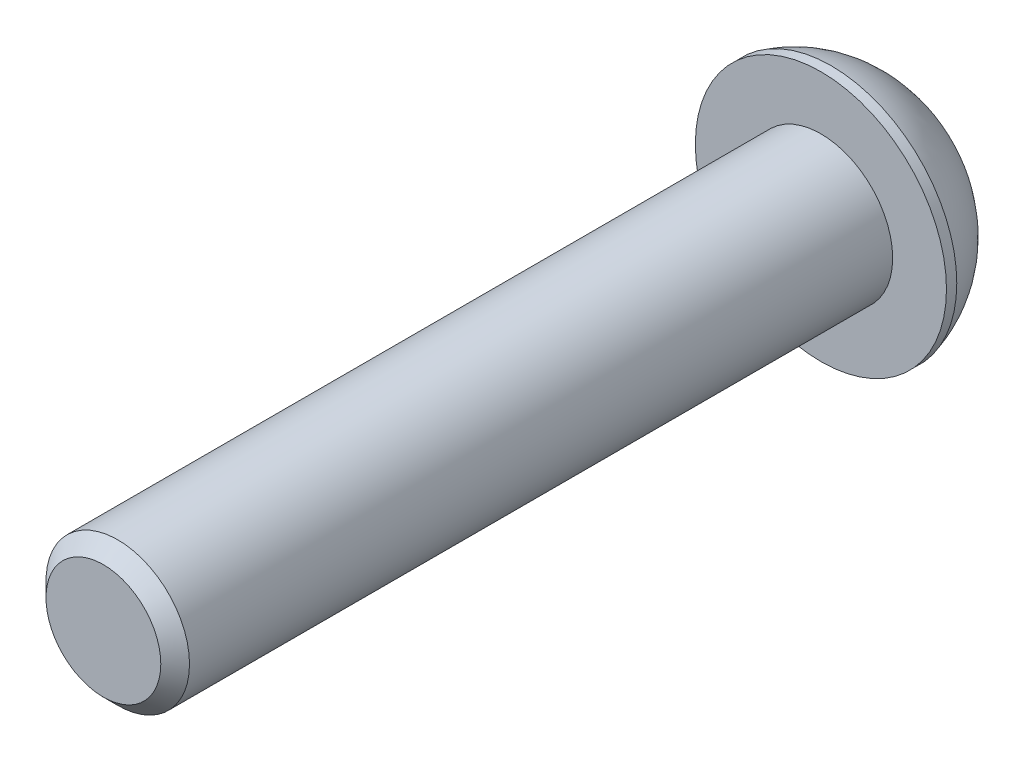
ISO-10303-21;
HEADER;
FILE_DESCRIPTION(('STEP AP214'),'2;1');
FILE_NAME('part.step','',(''),(''),'','','');
FILE_SCHEMA(('AUTOMOTIVE_DESIGN { 1 0 10303 214 1 1 1 1 }'));
ENDSEC;
DATA;
#1=APPLICATION_CONTEXT('core data for automotive mechanical design processes');
#2=APPLICATION_PROTOCOL_DEFINITION('international standard','automotive_design',2000,#1);
#3=PRODUCT_CONTEXT('',#1,'mechanical');
#4=PRODUCT('Part','Part','',(#3));
#5=PRODUCT_RELATED_PRODUCT_CATEGORY('part','',(#4));
#6=PRODUCT_DEFINITION_FORMATION('','',#4);
#7=PRODUCT_DEFINITION_CONTEXT('part definition',#1,'design');
#8=PRODUCT_DEFINITION('design','',#6,#7);
#9=PRODUCT_DEFINITION_SHAPE('','',#8);
#10=(LENGTH_UNIT() NAMED_UNIT(*) SI_UNIT(.MILLI.,.METRE.));
#11=(NAMED_UNIT(*) PLANE_ANGLE_UNIT() SI_UNIT($,.RADIAN.));
#12=(NAMED_UNIT(*) SI_UNIT($,.STERADIAN.) SOLID_ANGLE_UNIT());
#13=UNCERTAINTY_MEASURE_WITH_UNIT(LENGTH_MEASURE(1.E-05),#10,'distance_accuracy_value','');
#14=(GEOMETRIC_REPRESENTATION_CONTEXT(3) GLOBAL_UNCERTAINTY_ASSIGNED_CONTEXT((#13)) GLOBAL_UNIT_ASSIGNED_CONTEXT((#10,
#11,#12)) REPRESENTATION_CONTEXT('',''));
#15=CARTESIAN_POINT('',(0.,0.,0.));
#16=DIRECTION('',(0.,0.,1.));
#17=DIRECTION('',(1.,0.,0.));
#18=AXIS2_PLACEMENT_3D('',#15,#16,#17);
#19=CARTESIAN_POINT('',(0.,0.,-4.4));
#20=DIRECTION('',(0.,0.,1.));
#21=DIRECTION('',(1.,0.,0.));
#22=AXIS2_PLACEMENT_3D('',#19,#20,#21);
#23=PLANE('',#22);
#24=CARTESIAN_POINT('',(0.,0.,-4.4));
#25=DIRECTION('',(0.,0.,-1.));
#26=DIRECTION('',(-1.,0.,0.));
#27=AXIS2_PLACEMENT_3D('',#24,#25,#26);
#28=CIRCLE('',#27,4.06492341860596);
#29=CARTESIAN_POINT('',(-4.06492341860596,0.,-4.4));
#30=VERTEX_POINT('',#29);
#31=EDGE_CURVE('E148',#30,#30,#28,.T.);
#32=ORIENTED_EDGE('',*,*,#31,.T.);
#33=EDGE_LOOP('',(#32));
#34=FACE_BOUND('',#33,.T.);
#35=DIRECTION('',(-0.86602540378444,0.499999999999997,0.));
#36=VECTOR('',#35,1.);
#37=CARTESIAN_POINT('',(0.,2.88675134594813,-4.4));
#38=LINE('',#37,#36);
#39=CARTESIAN_POINT('',(2.5,1.44337567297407,-4.4));
#40=VERTEX_POINT('',#39);
#41=CARTESIAN_POINT('',(0.,2.88675134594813,-4.4));
#42=VERTEX_POINT('',#41);
#43=EDGE_CURVE('E50',#40,#42,#38,.T.);
#44=ORIENTED_EDGE('',*,*,#43,.T.);
#45=DIRECTION('',(-0.866025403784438,-0.500000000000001,0.));
#46=VECTOR('',#45,1.);
#47=CARTESIAN_POINT('',(0.,2.88675134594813,-4.4));
#48=LINE('',#47,#46);
#49=CARTESIAN_POINT('',(-2.5,1.44337567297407,-4.4));
#50=VERTEX_POINT('',#49);
#51=EDGE_CURVE('E121',#42,#50,#48,.T.);
#52=ORIENTED_EDGE('',*,*,#51,.T.);
#53=DIRECTION('',(0.,-1.,0.));
#54=VECTOR('',#53,1.);
#55=CARTESIAN_POINT('',(-2.5,-1.44337567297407,-4.4));
#56=LINE('',#55,#54);
#57=CARTESIAN_POINT('',(-2.5,-1.44337567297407,-4.4));
#58=VERTEX_POINT('',#57);
#59=EDGE_CURVE('E125',#50,#58,#56,.T.);
#60=ORIENTED_EDGE('',*,*,#59,.T.);
#61=DIRECTION('',(0.866025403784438,-0.500000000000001,0.));
#62=VECTOR('',#61,1.);
#63=CARTESIAN_POINT('',(0.,-2.88675134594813,-4.4));
#64=LINE('',#63,#62);
#65=CARTESIAN_POINT('',(0.,-2.88675134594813,-4.4));
#66=VERTEX_POINT('',#65);
#67=EDGE_CURVE('E128',#58,#66,#64,.T.);
#68=ORIENTED_EDGE('',*,*,#67,.T.);
#69=DIRECTION('',(0.86602540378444,0.499999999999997,0.));
#70=VECTOR('',#69,1.);
#71=CARTESIAN_POINT('',(0.,-2.88675134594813,-4.4));
#72=LINE('',#71,#70);
#73=CARTESIAN_POINT('',(2.5,-1.44337567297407,-4.4));
#74=VERTEX_POINT('',#73);
#75=EDGE_CURVE('E111',#66,#74,#72,.T.);
#76=ORIENTED_EDGE('',*,*,#75,.T.);
#77=DIRECTION('',(0.,1.,0.));
#78=VECTOR('',#77,1.);
#79=CARTESIAN_POINT('',(2.5,-1.44337567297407,-4.4));
#80=LINE('',#79,#78);
#81=EDGE_CURVE('E131',#74,#40,#80,.T.);
#82=ORIENTED_EDGE('',*,*,#81,.T.);
#83=EDGE_LOOP('',(#44,#52,#60,#68,#76,#82));
#84=FACE_BOUND('',#83,.T.);
#85=ADVANCED_FACE('F35',(#34,#84),#23,.F.);
#86=CARTESIAN_POINT('',(0.,0.,1.05548398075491));
#87=DIRECTION('',(0.,0.,-1.));
#88=DIRECTION('',(-1.,0.,0.));
#89=AXIS2_PLACEMENT_3D('',#86,#87,#88);
#90=DEGENERATE_TOROIDAL_SURFACE('',#89,0.915198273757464,6.29945028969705,.T.);
#91=ORIENTED_EDGE('',*,*,#31,.F.);
#92=EDGE_LOOP('',(#91));
#93=FACE_BOUND('',#92,.T.);
#94=CARTESIAN_POINT('',(0.,0.,-0.574933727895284));
#95=DIRECTION('',(0.,0.,-1.));
#96=DIRECTION('',(-1.,0.,0.));
#97=AXIS2_PLACEMENT_3D('',#94,#95,#96);
#98=CIRCLE('',#97,7.);
#99=CARTESIAN_POINT('',(-7.,0.,-0.574933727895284));
#100=VERTEX_POINT('',#99);
#101=EDGE_CURVE('E145',#100,#100,#98,.T.);
#102=ORIENTED_EDGE('',*,*,#101,.T.);
#103=EDGE_LOOP('',(#102));
#104=FACE_BOUND('',#103,.T.);
#105=ADVANCED_FACE('F165',(#93,#104),#90,.T.);
#106=CARTESIAN_POINT('',(0.,0.,0.));
#107=DIRECTION('',(0.,0.,-1.));
#108=DIRECTION('',(-1.,0.,0.));
#109=AXIS2_PLACEMENT_3D('',#106,#107,#108);
#110=CYLINDRICAL_SURFACE('',#109,7.);
#111=ORIENTED_EDGE('',*,*,#101,.F.);
#112=EDGE_LOOP('',(#111));
#113=FACE_BOUND('',#112,.T.);
#114=CARTESIAN_POINT('',(0.,0.,0.));
#115=DIRECTION('',(0.,0.,-1.));
#116=DIRECTION('',(-1.,0.,0.));
#117=AXIS2_PLACEMENT_3D('',#114,#115,#116);
#118=CIRCLE('',#117,7.);
#119=CARTESIAN_POINT('',(-7.,0.,0.));
#120=VERTEX_POINT('',#119);
#121=EDGE_CURVE('E142',#120,#120,#118,.T.);
#122=ORIENTED_EDGE('',*,*,#121,.T.);
#123=EDGE_LOOP('',(#122));
#124=FACE_BOUND('',#123,.T.);
#125=ADVANCED_FACE('F170',(#113,#124),#110,.T.);
#126=CARTESIAN_POINT('',(0.,0.,0.));
#127=DIRECTION('',(0.,0.,-1.));
#128=DIRECTION('',(-1.,0.,0.));
#129=AXIS2_PLACEMENT_3D('',#126,#127,#128);
#130=PLANE('',#129);
#131=CARTESIAN_POINT('',(0.,0.,0.));
#132=DIRECTION('',(0.,0.,1.));
#133=DIRECTION('',(1.,0.,0.));
#134=AXIS2_PLACEMENT_3D('',#131,#132,#133);
#135=CIRCLE('',#134,4.);
#136=CARTESIAN_POINT('',(4.,0.,0.));
#137=VERTEX_POINT('',#136);
#138=EDGE_CURVE('E122',#137,#137,#135,.T.);
#139=ORIENTED_EDGE('',*,*,#138,.F.);
#140=EDGE_LOOP('',(#139));
#141=FACE_BOUND('',#140,.T.);
#142=ORIENTED_EDGE('',*,*,#121,.F.);
#143=EDGE_LOOP('',(#142));
#144=FACE_BOUND('',#143,.T.);
#145=ADVANCED_FACE('F177',(#141,#144),#130,.F.);
#146=CARTESIAN_POINT('',(0.,2.88675134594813,-1.8));
#147=DIRECTION('',(-0.499999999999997,-0.86602540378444,0.));
#148=DIRECTION('',(0.86602540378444,-0.499999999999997,0.));
#149=AXIS2_PLACEMENT_3D('',#146,#147,#148);
#150=PLANE('',#149);
#151=ORIENTED_EDGE('',*,*,#43,.F.);
#152=DIRECTION('',(0.,0.,-1.));
#153=VECTOR('',#152,1.);
#154=CARTESIAN_POINT('',(2.5,1.44337567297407,-1.8));
#155=LINE('',#154,#153);
#156=CARTESIAN_POINT('',(2.5,1.44337567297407,-1.8));
#157=VERTEX_POINT('',#156);
#158=EDGE_CURVE('E116',#157,#40,#155,.T.);
#159=ORIENTED_EDGE('',*,*,#158,.F.);
#160=DIRECTION('',(-0.86602540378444,0.499999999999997,0.));
#161=VECTOR('',#160,1.);
#162=CARTESIAN_POINT('',(0.,2.88675134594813,-1.8));
#163=LINE('',#162,#161);
#164=CARTESIAN_POINT('',(0.,2.88675134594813,-1.8));
#165=VERTEX_POINT('',#164);
#166=EDGE_CURVE('E134',#157,#165,#163,.T.);
#167=ORIENTED_EDGE('',*,*,#166,.T.);
#168=DIRECTION('',(0.,0.,-1.));
#169=VECTOR('',#168,1.);
#170=CARTESIAN_POINT('',(0.,2.88675134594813,-1.8));
#171=LINE('',#170,#169);
#172=EDGE_CURVE('E140',#165,#42,#171,.T.);
#173=ORIENTED_EDGE('',*,*,#172,.T.);
#174=EDGE_LOOP('',(#151,#159,#167,#173));
#175=FACE_BOUND('',#174,.T.);
#176=ADVANCED_FACE('F181',(#175),#150,.T.);
#177=CARTESIAN_POINT('',(0.,2.88675134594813,-1.8));
#178=DIRECTION('',(0.500000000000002,-0.866025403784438,0.));
#179=DIRECTION('',(0.866025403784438,0.500000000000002,0.));
#180=AXIS2_PLACEMENT_3D('',#177,#178,#179);
#181=PLANE('',#180);
#182=ORIENTED_EDGE('',*,*,#51,.F.);
#183=ORIENTED_EDGE('',*,*,#172,.F.);
#184=DIRECTION('',(-0.866025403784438,-0.500000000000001,0.));
#185=VECTOR('',#184,1.);
#186=CARTESIAN_POINT('',(0.,2.88675134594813,-1.8));
#187=LINE('',#186,#185);
#188=CARTESIAN_POINT('',(-2.5,1.44337567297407,-1.8));
#189=VERTEX_POINT('',#188);
#190=EDGE_CURVE('E89',#165,#189,#187,.T.);
#191=ORIENTED_EDGE('',*,*,#190,.T.);
#192=DIRECTION('',(0.,0.,-1.));
#193=VECTOR('',#192,1.);
#194=CARTESIAN_POINT('',(-2.5,1.44337567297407,-1.8));
#195=LINE('',#194,#193);
#196=EDGE_CURVE('E138',#189,#50,#195,.T.);
#197=ORIENTED_EDGE('',*,*,#196,.T.);
#198=EDGE_LOOP('',(#182,#183,#191,#197));
#199=FACE_BOUND('',#198,.T.);
#200=ADVANCED_FACE('F185',(#199),#181,.T.);
#201=CARTESIAN_POINT('',(-2.5,-1.44337567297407,-1.8));
#202=DIRECTION('',(1.,0.,0.));
#203=DIRECTION('',(0.,0.,-1.));
#204=AXIS2_PLACEMENT_3D('',#201,#202,#203);
#205=PLANE('',#204);
#206=ORIENTED_EDGE('',*,*,#59,.F.);
#207=ORIENTED_EDGE('',*,*,#196,.F.);
#208=DIRECTION('',(0.,-1.,0.));
#209=VECTOR('',#208,1.);
#210=CARTESIAN_POINT('',(-2.5,-1.44337567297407,-1.8));
#211=LINE('',#210,#209);
#212=CARTESIAN_POINT('',(-2.5,-1.44337567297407,-1.8));
#213=VERTEX_POINT('',#212);
#214=EDGE_CURVE('E107',#189,#213,#211,.T.);
#215=ORIENTED_EDGE('',*,*,#214,.T.);
#216=DIRECTION('',(0.,0.,-1.));
#217=VECTOR('',#216,1.);
#218=CARTESIAN_POINT('',(-2.5,-1.44337567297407,-1.8));
#219=LINE('',#218,#217);
#220=EDGE_CURVE('E104',#213,#58,#219,.T.);
#221=ORIENTED_EDGE('',*,*,#220,.T.);
#222=EDGE_LOOP('',(#206,#207,#215,#221));
#223=FACE_BOUND('',#222,.T.);
#224=ADVANCED_FACE('F188',(#223),#205,.T.);
#225=CARTESIAN_POINT('',(0.,-2.88675134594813,-1.8));
#226=DIRECTION('',(0.500000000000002,0.866025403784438,0.));
#227=DIRECTION('',(-0.866025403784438,0.500000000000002,0.));
#228=AXIS2_PLACEMENT_3D('',#225,#226,#227);
#229=PLANE('',#228);
#230=ORIENTED_EDGE('',*,*,#67,.F.);
#231=ORIENTED_EDGE('',*,*,#220,.F.);
#232=DIRECTION('',(0.866025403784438,-0.500000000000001,0.));
#233=VECTOR('',#232,1.);
#234=CARTESIAN_POINT('',(0.,-2.88675134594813,-1.8));
#235=LINE('',#234,#233);
#236=CARTESIAN_POINT('',(0.,-2.88675134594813,-1.8));
#237=VERTEX_POINT('',#236);
#238=EDGE_CURVE('E99',#213,#237,#235,.T.);
#239=ORIENTED_EDGE('',*,*,#238,.T.);
#240=DIRECTION('',(0.,0.,-1.));
#241=VECTOR('',#240,1.);
#242=CARTESIAN_POINT('',(0.,-2.88675134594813,-1.8));
#243=LINE('',#242,#241);
#244=EDGE_CURVE('E103',#237,#66,#243,.T.);
#245=ORIENTED_EDGE('',*,*,#244,.T.);
#246=EDGE_LOOP('',(#230,#231,#239,#245));
#247=FACE_BOUND('',#246,.T.);
#248=ADVANCED_FACE('F102',(#247),#229,.T.);
#249=CARTESIAN_POINT('',(0.,-2.88675134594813,-1.8));
#250=DIRECTION('',(-0.499999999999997,0.86602540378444,0.));
#251=DIRECTION('',(-0.86602540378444,-0.499999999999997,0.));
#252=AXIS2_PLACEMENT_3D('',#249,#250,#251);
#253=PLANE('',#252);
#254=ORIENTED_EDGE('',*,*,#75,.F.);
#255=ORIENTED_EDGE('',*,*,#244,.F.);
#256=DIRECTION('',(0.86602540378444,0.499999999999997,0.));
#257=VECTOR('',#256,1.);
#258=CARTESIAN_POINT('',(0.,-2.88675134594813,-1.8));
#259=LINE('',#258,#257);
#260=CARTESIAN_POINT('',(2.5,-1.44337567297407,-1.8));
#261=VERTEX_POINT('',#260);
#262=EDGE_CURVE('E106',#237,#261,#259,.T.);
#263=ORIENTED_EDGE('',*,*,#262,.T.);
#264=DIRECTION('',(0.,0.,-1.));
#265=VECTOR('',#264,1.);
#266=CARTESIAN_POINT('',(2.5,-1.44337567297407,-1.8));
#267=LINE('',#266,#265);
#268=EDGE_CURVE('E80',#261,#74,#267,.T.);
#269=ORIENTED_EDGE('',*,*,#268,.T.);
#270=EDGE_LOOP('',(#254,#255,#263,#269));
#271=FACE_BOUND('',#270,.T.);
#272=ADVANCED_FACE('F109',(#271),#253,.T.);
#273=CARTESIAN_POINT('',(2.5,-1.44337567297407,-1.8));
#274=DIRECTION('',(-1.,0.,0.));
#275=DIRECTION('',(0.,0.,1.));
#276=AXIS2_PLACEMENT_3D('',#273,#274,#275);
#277=PLANE('',#276);
#278=ORIENTED_EDGE('',*,*,#81,.F.);
#279=ORIENTED_EDGE('',*,*,#268,.F.);
#280=DIRECTION('',(0.,1.,0.));
#281=VECTOR('',#280,1.);
#282=CARTESIAN_POINT('',(2.5,-1.44337567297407,-1.8));
#283=LINE('',#282,#281);
#284=EDGE_CURVE('E58',#261,#157,#283,.T.);
#285=ORIENTED_EDGE('',*,*,#284,.T.);
#286=ORIENTED_EDGE('',*,*,#158,.T.);
#287=EDGE_LOOP('',(#278,#279,#285,#286));
#288=FACE_BOUND('',#287,.T.);
#289=ADVANCED_FACE('F197',(#288),#277,.T.);
#290=CARTESIAN_POINT('',(2.5,1.44337567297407,-1.8));
#291=DIRECTION('',(0.,0.,1.));
#292=DIRECTION('',(1.,0.,0.));
#293=AXIS2_PLACEMENT_3D('',#290,#291,#292);
#294=PLANE('',#293);
#295=ORIENTED_EDGE('',*,*,#166,.F.);
#296=ORIENTED_EDGE('',*,*,#284,.F.);
#297=ORIENTED_EDGE('',*,*,#262,.F.);
#298=ORIENTED_EDGE('',*,*,#238,.F.);
#299=ORIENTED_EDGE('',*,*,#214,.F.);
#300=ORIENTED_EDGE('',*,*,#190,.F.);
#301=EDGE_LOOP('',(#295,#296,#297,#298,#299,#300));
#302=FACE_BOUND('',#301,.T.);
#303=ADVANCED_FACE('F114',(#302),#294,.F.);
#304=CARTESIAN_POINT('',(0.,0.,40.));
#305=DIRECTION('',(0.,0.,1.));
#306=DIRECTION('',(1.,0.,0.));
#307=AXIS2_PLACEMENT_3D('',#304,#305,#306);
#308=PLANE('',#307);
#309=CARTESIAN_POINT('',(0.,0.,40.));
#310=DIRECTION('',(0.,0.,1.));
#311=DIRECTION('',(1.,0.,0.));
#312=AXIS2_PLACEMENT_3D('',#309,#310,#311);
#313=CIRCLE('',#312,3.2);
#314=CARTESIAN_POINT('',(3.20000000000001,0.,40.));
#315=VERTEX_POINT('',#314);
#316=EDGE_CURVE('E43',#315,#315,#313,.T.);
#317=ORIENTED_EDGE('',*,*,#316,.T.);
#318=EDGE_LOOP('',(#317));
#319=FACE_BOUND('',#318,.T.);
#320=ADVANCED_FACE('F153',(#319),#308,.T.);
#321=CARTESIAN_POINT('',(0.,0.,0.));
#322=DIRECTION('',(0.,0.,1.));
#323=DIRECTION('',(1.,0.,0.));
#324=AXIS2_PLACEMENT_3D('',#321,#322,#323);
#325=CYLINDRICAL_SURFACE('',#324,4.);
#326=CARTESIAN_POINT('',(0.,0.,39.2));
#327=DIRECTION('',(0.,0.,1.));
#328=DIRECTION('',(1.,0.,0.));
#329=AXIS2_PLACEMENT_3D('',#326,#327,#328);
#330=CIRCLE('',#329,4.);
#331=CARTESIAN_POINT('',(4.00000000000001,0.,39.2));
#332=VERTEX_POINT('',#331);
#333=EDGE_CURVE('E11',#332,#332,#330,.F.);
#334=ORIENTED_EDGE('',*,*,#333,.T.);
#335=EDGE_LOOP('',(#334));
#336=FACE_BOUND('',#335,.T.);
#337=ORIENTED_EDGE('',*,*,#138,.T.);
#338=EDGE_LOOP('',(#337));
#339=FACE_BOUND('',#338,.T.);
#340=ADVANCED_FACE('F156',(#336,#339),#325,.T.);
#341=CARTESIAN_POINT('',(0.,0.,40.));
#342=DIRECTION('',(0.,0.,-1.));
#343=DIRECTION('',(-1.,0.,0.));
#344=AXIS2_PLACEMENT_3D('',#341,#342,#343);
#345=CONICAL_SURFACE('',#344,3.2,0.78539816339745);
#346=ORIENTED_EDGE('',*,*,#333,.F.);
#347=EDGE_LOOP('',(#346));
#348=FACE_BOUND('',#347,.T.);
#349=ORIENTED_EDGE('',*,*,#316,.F.);
#350=EDGE_LOOP('',(#349));
#351=FACE_BOUND('',#350,.T.);
#352=ADVANCED_FACE('F37',(#348,#351),#345,.T.);
#353=CLOSED_SHELL('',(#85,#105,#125,#145,#176,#200,#224,#248,#272,#289,#303,#320,#340,#352));
#354=MANIFOLD_SOLID_BREP('B2',#353);
#355=ADVANCED_BREP_SHAPE_REPRESENTATION('',(#18,#354),#14);
#356=SHAPE_DEFINITION_REPRESENTATION(#9,#355);
ENDSEC;
END-ISO-10303-21;
